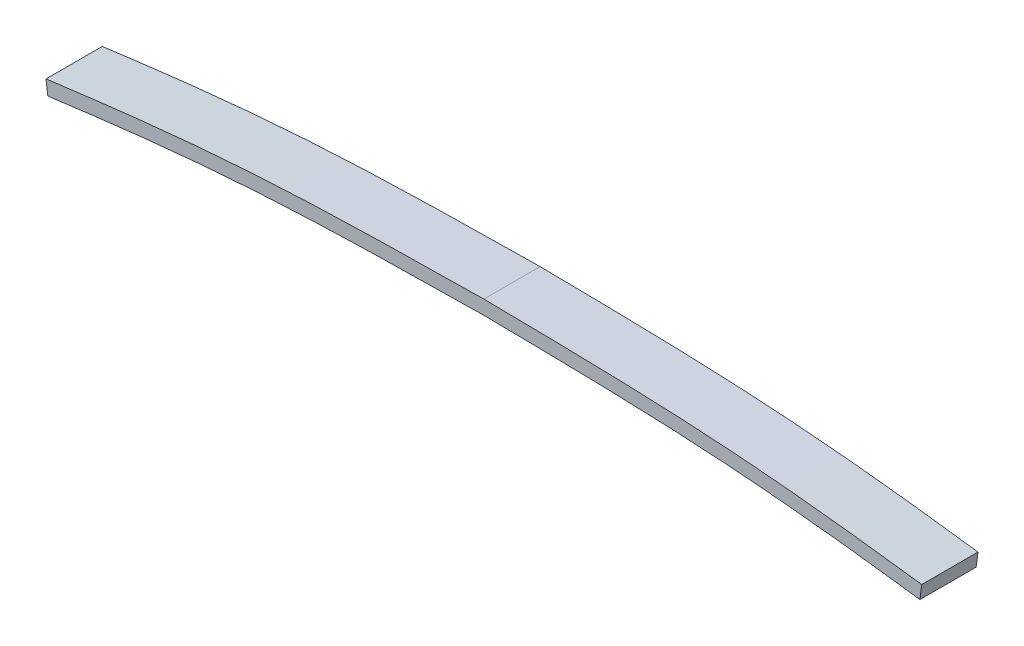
ISO-10303-21;
HEADER;
FILE_DESCRIPTION(('STEP AP214'),'2;1');
FILE_NAME('part.step','',(''),(''),'','','');
FILE_SCHEMA(('AUTOMOTIVE_DESIGN { 1 0 10303 214 1 1 1 1 }'));
ENDSEC;
DATA;
#1=APPLICATION_CONTEXT('core data for automotive mechanical design processes');
#2=APPLICATION_PROTOCOL_DEFINITION('international standard','automotive_design',2000,#1);
#3=PRODUCT_CONTEXT('',#1,'mechanical');
#4=PRODUCT('Part','Part','',(#3));
#5=PRODUCT_RELATED_PRODUCT_CATEGORY('part','',(#4));
#6=PRODUCT_DEFINITION_FORMATION('','',#4);
#7=PRODUCT_DEFINITION_CONTEXT('part definition',#1,'design');
#8=PRODUCT_DEFINITION('design','',#6,#7);
#9=PRODUCT_DEFINITION_SHAPE('','',#8);
#10=(LENGTH_UNIT() NAMED_UNIT(*) SI_UNIT(.MILLI.,.METRE.));
#11=(NAMED_UNIT(*) PLANE_ANGLE_UNIT() SI_UNIT($,.RADIAN.));
#12=(NAMED_UNIT(*) SI_UNIT($,.STERADIAN.) SOLID_ANGLE_UNIT());
#13=UNCERTAINTY_MEASURE_WITH_UNIT(LENGTH_MEASURE(1.E-05),#10,'distance_accuracy_value','');
#14=(GEOMETRIC_REPRESENTATION_CONTEXT(3) GLOBAL_UNCERTAINTY_ASSIGNED_CONTEXT((#13)) GLOBAL_UNIT_ASSIGNED_CONTEXT((#10,
#11,#12)) REPRESENTATION_CONTEXT('',''));
#15=CARTESIAN_POINT('',(0.,0.,0.));
#16=DIRECTION('',(0.,0.,1.));
#17=DIRECTION('',(1.,0.,0.));
#18=AXIS2_PLACEMENT_3D('',#15,#16,#17);
#19=CARTESIAN_POINT('',(0.,0.300008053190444,0.4));
#20=CARTESIAN_POINT('',(-0.518560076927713,0.29342682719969,0.4));
#21=CARTESIAN_POINT('',(-1.03864642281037,0.286880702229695,0.4));
#22=CARTESIAN_POINT('',(-1.81924267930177,0.241164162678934,0.4));
#23=CARTESIAN_POINT('',(-2.07925298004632,0.219512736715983,0.4));
#24=CARTESIAN_POINT('',(-2.59760359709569,0.165550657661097,0.4));
#25=CARTESIAN_POINT('',(-2.85583231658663,0.132464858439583,0.4));
#26=CARTESIAN_POINT('',(-3.11284659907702,0.0991713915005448,0.4));
#27=B_SPLINE_CURVE_WITH_KNOTS('',3,(#19,#20,#21,#22,#23,#24,#25,#26),.UNSPECIFIED.,.F.,.F.,(4,2,
2,4),(0.,0.5,0.75,1.),.UNSPECIFIED.);
#28=DIRECTION('',(0.,0.,-1.));
#29=VECTOR('',#28,1.);
#30=SURFACE_OF_LINEAR_EXTRUSION('',#27,#29);
#31=CARTESIAN_POINT('',(0.,0.300008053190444,0.));
#32=CARTESIAN_POINT('',(-0.518560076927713,0.29342682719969,0.));
#33=CARTESIAN_POINT('',(-1.03864642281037,0.286880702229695,0.));
#34=CARTESIAN_POINT('',(-1.81924267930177,0.241164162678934,0.));
#35=CARTESIAN_POINT('',(-2.07925298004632,0.219512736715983,0.));
#36=CARTESIAN_POINT('',(-2.59760359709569,0.165550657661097,0.));
#37=CARTESIAN_POINT('',(-2.85583231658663,0.132464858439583,0.));
#38=CARTESIAN_POINT('',(-3.11284659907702,0.0991713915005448,0.));
#39=B_SPLINE_CURVE_WITH_KNOTS('',3,(#31,#32,#33,#34,#35,#36,#37,#38),.UNSPECIFIED.,.F.,.F.,(4,2,
2,4),(0.,0.5,0.75,1.),.UNSPECIFIED.);
#40=CARTESIAN_POINT('',(0.,0.300008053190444,0.));
#41=VERTEX_POINT('',#40);
#42=CARTESIAN_POINT('',(-3.11284659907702,0.0991713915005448,0.));
#43=VERTEX_POINT('',#42);
#44=EDGE_CURVE('E413',#41,#43,#39,.T.);
#45=ORIENTED_EDGE('',*,*,#44,.T.);
#46=DIRECTION('',(0.,0.,-1.));
#47=VECTOR('',#46,1.);
#48=CARTESIAN_POINT('',(-3.11284659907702,0.0991713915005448,0.4));
#49=LINE('',#48,#47);
#50=CARTESIAN_POINT('',(-3.11284659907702,0.0991713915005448,0.4));
#51=VERTEX_POINT('',#50);
#52=EDGE_CURVE('E11',#51,#43,#49,.T.);
#53=ORIENTED_EDGE('',*,*,#52,.F.);
#54=CARTESIAN_POINT('',(0.,0.300008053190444,0.4));
#55=VERTEX_POINT('',#54);
#56=EDGE_CURVE('E445',#55,#51,#27,.T.);
#57=ORIENTED_EDGE('',*,*,#56,.F.);
#58=DIRECTION('',(0.,0.,-1.));
#59=VECTOR('',#58,1.);
#60=CARTESIAN_POINT('',(0.,0.300008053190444,0.4));
#61=LINE('',#60,#59);
#62=EDGE_CURVE('E414',#55,#41,#61,.T.);
#63=ORIENTED_EDGE('',*,*,#62,.T.);
#64=EDGE_LOOP('',(#45,#53,#57,#63));
#65=FACE_BOUND('',#64,.T.);
#66=ADVANCED_FACE('F348',(#65),#30,.F.);
#67=CARTESIAN_POINT('',(-3.1,0.,0.4));
#68=DIRECTION('',(-0.991713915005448,-0.128465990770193,0.));
#69=DIRECTION('',(0.128465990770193,-0.991713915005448,0.));
#70=AXIS2_PLACEMENT_3D('',#67,#68,#69);
#71=PLANE('',#70);
#72=DIRECTION('',(-0.128465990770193,0.991713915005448,0.));
#73=VECTOR('',#72,1.);
#74=CARTESIAN_POINT('',(-3.1,0.,0.));
#75=LINE('',#74,#73);
#76=CARTESIAN_POINT('',(-3.1,0.,0.));
#77=VERTEX_POINT('',#76);
#78=EDGE_CURVE('E405',#77,#43,#75,.T.);
#79=ORIENTED_EDGE('',*,*,#78,.F.);
#80=DIRECTION('',(0.,0.,-1.));
#81=VECTOR('',#80,1.);
#82=CARTESIAN_POINT('',(-3.1,0.,0.4));
#83=LINE('',#82,#81);
#84=CARTESIAN_POINT('',(-3.1,0.,0.4));
#85=VERTEX_POINT('',#84);
#86=EDGE_CURVE('E356',#85,#77,#83,.T.);
#87=ORIENTED_EDGE('',*,*,#86,.F.);
#88=DIRECTION('',(-0.128465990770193,0.991713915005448,0.));
#89=VECTOR('',#88,1.);
#90=CARTESIAN_POINT('',(-3.1,0.,0.4));
#91=LINE('',#90,#89);
#92=EDGE_CURVE('E408',#85,#51,#91,.T.);
#93=ORIENTED_EDGE('',*,*,#92,.T.);
#94=ORIENTED_EDGE('',*,*,#52,.T.);
#95=EDGE_LOOP('',(#79,#87,#93,#94));
#96=FACE_BOUND('',#95,.T.);
#97=ADVANCED_FACE('F403',(#96),#71,.T.);
#98=CARTESIAN_POINT('',(0.,0.2,0.4));
#99=CARTESIAN_POINT('',(-0.553676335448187,0.192973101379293,0.4));
#100=CARTESIAN_POINT('',(-1.40866365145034,0.182122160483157,0.4));
#101=CARTESIAN_POINT('',(-2.44107820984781,0.085356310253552,0.4));
#102=CARTESIAN_POINT('',(-2.9198780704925,0.0233328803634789,0.4));
#103=CARTESIAN_POINT('',(-3.1,0.,0.4));
#104=B_SPLINE_CURVE_WITH_KNOTS('',3,(#98,#99,#100,#101,#102,#103),.UNSPECIFIED.,.F.,.F.,(4,1,1,
4),(0.,0.534077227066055,0.824722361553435,1.),.UNSPECIFIED.);
#105=DIRECTION('',(0.,0.,-1.));
#106=VECTOR('',#105,1.);
#107=SURFACE_OF_LINEAR_EXTRUSION('',#104,#106);
#108=CARTESIAN_POINT('',(0.,0.2,0.));
#109=CARTESIAN_POINT('',(-0.553676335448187,0.192973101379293,0.));
#110=CARTESIAN_POINT('',(-1.40866365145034,0.182122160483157,0.));
#111=CARTESIAN_POINT('',(-2.44107820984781,0.085356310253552,0.));
#112=CARTESIAN_POINT('',(-2.9198780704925,0.0233328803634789,0.));
#113=CARTESIAN_POINT('',(-3.1,0.,0.));
#114=B_SPLINE_CURVE_WITH_KNOTS('',3,(#108,#109,#110,#111,#112,#113),.UNSPECIFIED.,.F.,.F.,(4,1,
1,4),(0.,0.534077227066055,0.824722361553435,1.),.UNSPECIFIED.);
#115=CARTESIAN_POINT('',(0.,0.2,0.));
#116=VERTEX_POINT('',#115);
#117=EDGE_CURVE('E421',#116,#77,#114,.T.);
#118=ORIENTED_EDGE('',*,*,#117,.F.);
#119=DIRECTION('',(0.,0.,-1.));
#120=VECTOR('',#119,1.);
#121=CARTESIAN_POINT('',(0.,0.2,0.4));
#122=LINE('',#121,#120);
#123=CARTESIAN_POINT('',(0.,0.2,0.4));
#124=VERTEX_POINT('',#123);
#125=EDGE_CURVE('E538',#124,#116,#122,.T.);
#126=ORIENTED_EDGE('',*,*,#125,.F.);
#127=EDGE_CURVE('E457',#124,#85,#104,.T.);
#128=ORIENTED_EDGE('',*,*,#127,.T.);
#129=ORIENTED_EDGE('',*,*,#86,.T.);
#130=EDGE_LOOP('',(#118,#126,#128,#129));
#131=FACE_BOUND('',#130,.T.);
#132=ADVANCED_FACE('F472',(#131),#107,.T.);
#133=CARTESIAN_POINT('',(3.1,0.,0.4));
#134=CARTESIAN_POINT('',(2.9198780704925,0.0233328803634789,0.4));
#135=CARTESIAN_POINT('',(2.44107820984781,0.085356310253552,0.4));
#136=CARTESIAN_POINT('',(1.40866365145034,0.182122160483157,0.4));
#137=CARTESIAN_POINT('',(0.553676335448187,0.192973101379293,0.4));
#138=CARTESIAN_POINT('',(0.,0.2,0.4));
#139=B_SPLINE_CURVE_WITH_KNOTS('',3,(#133,#134,#135,#136,#137,#138),.UNSPECIFIED.,.F.,.F.,(4,1,
1,4),(0.,0.175277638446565,0.465922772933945,1.),.UNSPECIFIED.);
#140=DIRECTION('',(0.,0.,-1.));
#141=VECTOR('',#140,1.);
#142=SURFACE_OF_LINEAR_EXTRUSION('',#139,#141);
#143=CARTESIAN_POINT('',(3.1,0.,0.));
#144=CARTESIAN_POINT('',(2.9198780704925,0.0233328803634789,0.));
#145=CARTESIAN_POINT('',(2.44107820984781,0.085356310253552,0.));
#146=CARTESIAN_POINT('',(1.40866365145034,0.182122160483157,0.));
#147=CARTESIAN_POINT('',(0.553676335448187,0.192973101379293,0.));
#148=CARTESIAN_POINT('',(0.,0.2,0.));
#149=B_SPLINE_CURVE_WITH_KNOTS('',3,(#143,#144,#145,#146,#147,#148),.UNSPECIFIED.,.F.,.F.,(4,1,
1,4),(0.,0.175277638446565,0.465922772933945,1.),.UNSPECIFIED.);
#150=CARTESIAN_POINT('',(3.1,0.,0.));
#151=VERTEX_POINT('',#150);
#152=EDGE_CURVE('E423',#151,#116,#149,.T.);
#153=ORIENTED_EDGE('',*,*,#152,.F.);
#154=DIRECTION('',(0.,0.,-1.));
#155=VECTOR('',#154,1.);
#156=CARTESIAN_POINT('',(3.1,0.,0.4));
#157=LINE('',#156,#155);
#158=CARTESIAN_POINT('',(3.1,0.,0.4));
#159=VERTEX_POINT('',#158);
#160=EDGE_CURVE('E536',#159,#151,#157,.T.);
#161=ORIENTED_EDGE('',*,*,#160,.F.);
#162=EDGE_CURVE('E463',#159,#124,#139,.T.);
#163=ORIENTED_EDGE('',*,*,#162,.T.);
#164=ORIENTED_EDGE('',*,*,#125,.T.);
#165=EDGE_LOOP('',(#153,#161,#163,#164));
#166=FACE_BOUND('',#165,.T.);
#167=ADVANCED_FACE('F475',(#166),#142,.T.);
#168=CARTESIAN_POINT('',(3.11284659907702,0.0991713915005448,0.4));
#169=DIRECTION('',(0.991713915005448,-0.128465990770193,0.));
#170=DIRECTION('',(0.128465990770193,0.991713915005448,0.));
#171=AXIS2_PLACEMENT_3D('',#168,#169,#170);
#172=PLANE('',#171);
#173=DIRECTION('',(-0.128465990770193,-0.991713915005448,0.));
#174=VECTOR('',#173,1.);
#175=CARTESIAN_POINT('',(3.11284659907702,0.0991713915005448,0.));
#176=LINE('',#175,#174);
#177=CARTESIAN_POINT('',(3.11284659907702,0.0991713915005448,0.));
#178=VERTEX_POINT('',#177);
#179=EDGE_CURVE('E436',#178,#151,#176,.T.);
#180=ORIENTED_EDGE('',*,*,#179,.F.);
#181=DIRECTION('',(0.,0.,-1.));
#182=VECTOR('',#181,1.);
#183=CARTESIAN_POINT('',(3.11284659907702,0.0991713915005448,0.4));
#184=LINE('',#183,#182);
#185=CARTESIAN_POINT('',(3.11284659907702,0.0991713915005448,0.4));
#186=VERTEX_POINT('',#185);
#187=EDGE_CURVE('E371',#186,#178,#184,.T.);
#188=ORIENTED_EDGE('',*,*,#187,.F.);
#189=DIRECTION('',(-0.128465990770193,-0.991713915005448,0.));
#190=VECTOR('',#189,1.);
#191=CARTESIAN_POINT('',(3.11284659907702,0.0991713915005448,0.4));
#192=LINE('',#191,#190);
#193=EDGE_CURVE('E530',#186,#159,#192,.T.);
#194=ORIENTED_EDGE('',*,*,#193,.T.);
#195=ORIENTED_EDGE('',*,*,#160,.T.);
#196=EDGE_LOOP('',(#180,#188,#194,#195));
#197=FACE_BOUND('',#196,.T.);
#198=ADVANCED_FACE('F497',(#197),#172,.T.);
#199=CARTESIAN_POINT('',(3.11284659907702,0.0991713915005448,0.4));
#200=CARTESIAN_POINT('',(2.85583231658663,0.132464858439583,0.4));
#201=CARTESIAN_POINT('',(2.59760359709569,0.165550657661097,0.4));
#202=CARTESIAN_POINT('',(2.07925298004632,0.219512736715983,0.4));
#203=CARTESIAN_POINT('',(1.81924267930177,0.241164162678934,0.4));
#204=CARTESIAN_POINT('',(1.03864642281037,0.286880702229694,0.4));
#205=CARTESIAN_POINT('',(0.518560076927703,0.293426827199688,0.4));
#206=CARTESIAN_POINT('',(0.,0.300008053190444,0.4));
#207=B_SPLINE_CURVE_WITH_KNOTS('',3,(#199,#200,#201,#202,#203,#204,#205,#206),.UNSPECIFIED.,.F.,
.F.,(4,2,2,4),(0.,0.25,0.5,1.),.UNSPECIFIED.);
#208=DIRECTION('',(0.,0.,-1.));
#209=VECTOR('',#208,1.);
#210=SURFACE_OF_LINEAR_EXTRUSION('',#207,#209);
#211=CARTESIAN_POINT('',(3.11284659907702,0.0991713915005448,0.));
#212=CARTESIAN_POINT('',(2.85583231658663,0.132464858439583,0.));
#213=CARTESIAN_POINT('',(2.59760359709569,0.165550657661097,0.));
#214=CARTESIAN_POINT('',(2.07925298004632,0.219512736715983,0.));
#215=CARTESIAN_POINT('',(1.81924267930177,0.241164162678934,0.));
#216=CARTESIAN_POINT('',(1.03864642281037,0.286880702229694,0.));
#217=CARTESIAN_POINT('',(0.518560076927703,0.293426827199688,0.));
#218=CARTESIAN_POINT('',(0.,0.300008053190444,0.));
#219=B_SPLINE_CURVE_WITH_KNOTS('',3,(#211,#212,#213,#214,#215,#216,#217,#218),.UNSPECIFIED.,.F.,
.F.,(4,2,2,4),(0.,0.25,0.5,1.),.UNSPECIFIED.);
#220=EDGE_CURVE('E442',#178,#41,#219,.T.);
#221=ORIENTED_EDGE('',*,*,#220,.T.);
#222=ORIENTED_EDGE('',*,*,#62,.F.);
#223=EDGE_CURVE('E363',#186,#55,#207,.T.);
#224=ORIENTED_EDGE('',*,*,#223,.F.);
#225=ORIENTED_EDGE('',*,*,#187,.T.);
#226=EDGE_LOOP('',(#221,#222,#224,#225));
#227=FACE_BOUND('',#226,.T.);
#228=ADVANCED_FACE('F504',(#227),#210,.F.);
#229=CARTESIAN_POINT('',(-1.55904392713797,0.256403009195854,0.4));
#230=DIRECTION('',(0.,0.,1.));
#231=DIRECTION('',(1.,0.,0.));
#232=AXIS2_PLACEMENT_3D('',#229,#230,#231);
#233=PLANE('',#232);
#234=ORIENTED_EDGE('',*,*,#56,.T.);
#235=ORIENTED_EDGE('',*,*,#92,.F.);
#236=ORIENTED_EDGE('',*,*,#127,.F.);
#237=ORIENTED_EDGE('',*,*,#162,.F.);
#238=ORIENTED_EDGE('',*,*,#193,.F.);
#239=ORIENTED_EDGE('',*,*,#223,.T.);
#240=EDGE_LOOP('',(#234,#235,#236,#237,#238,#239));
#241=FACE_BOUND('',#240,.T.);
#242=ADVANCED_FACE('F510',(#241),#233,.T.);
#243=CARTESIAN_POINT('',(-1.55904392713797,0.256403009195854,0.));
#244=DIRECTION('',(0.,0.,1.));
#245=DIRECTION('',(1.,0.,0.));
#246=AXIS2_PLACEMENT_3D('',#243,#244,#245);
#247=PLANE('',#246);
#248=ORIENTED_EDGE('',*,*,#44,.F.);
#249=ORIENTED_EDGE('',*,*,#220,.F.);
#250=ORIENTED_EDGE('',*,*,#179,.T.);
#251=ORIENTED_EDGE('',*,*,#152,.T.);
#252=ORIENTED_EDGE('',*,*,#117,.T.);
#253=ORIENTED_EDGE('',*,*,#78,.T.);
#254=EDGE_LOOP('',(#248,#249,#250,#251,#252,#253));
#255=FACE_BOUND('',#254,.T.);
#256=ADVANCED_FACE('F418',(#255),#247,.F.);
#257=CLOSED_SHELL('',(#66,#97,#132,#167,#198,#228,#242,#256));
#258=MANIFOLD_SOLID_BREP('B2',#257);
#259=ADVANCED_BREP_SHAPE_REPRESENTATION('',(#18,#258),#14);
#260=SHAPE_DEFINITION_REPRESENTATION(#9,#259);
ENDSEC;
END-ISO-10303-21;
